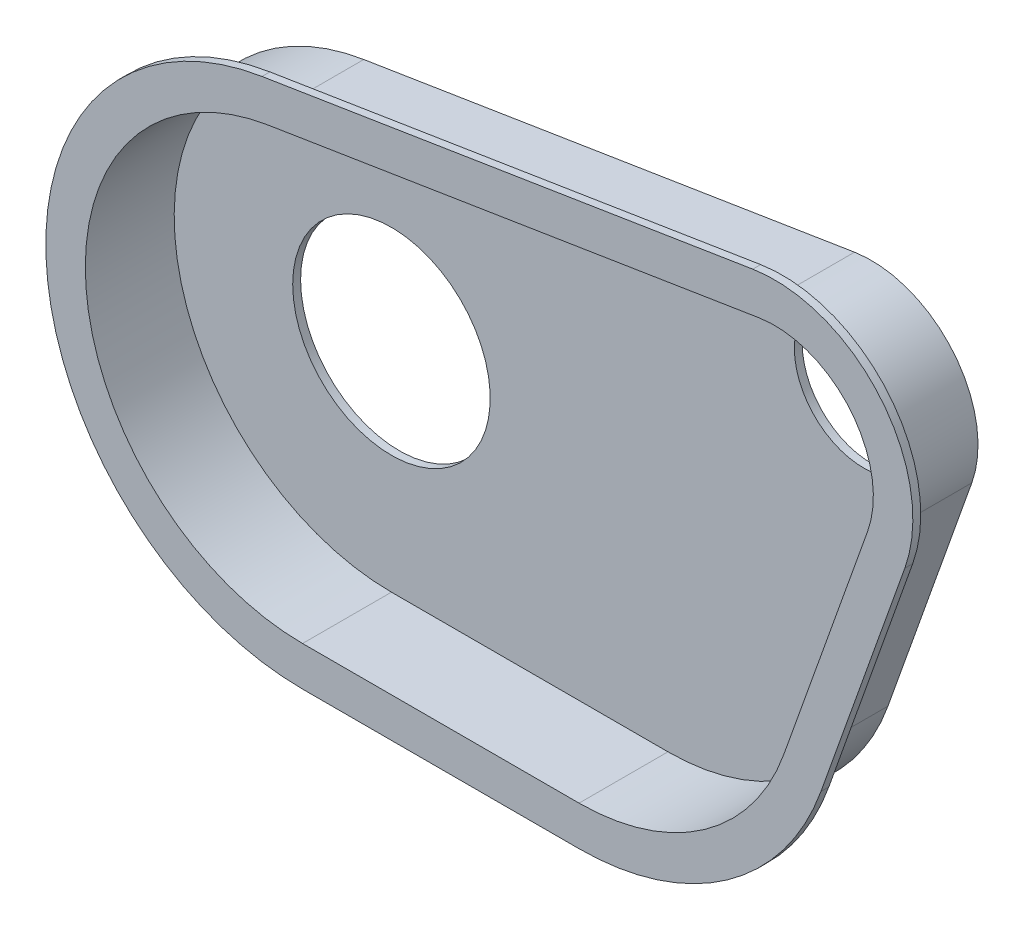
ISO-10303-21;
HEADER;
FILE_DESCRIPTION(('STEP AP214'),'2;1');
FILE_NAME('part.step','',(''),(''),'','','');
FILE_SCHEMA(('AUTOMOTIVE_DESIGN { 1 0 10303 214 1 1 1 1 }'));
ENDSEC;
DATA;
#1=APPLICATION_CONTEXT('core data for automotive mechanical design processes');
#2=APPLICATION_PROTOCOL_DEFINITION('international standard','automotive_design',2000,#1);
#3=PRODUCT_CONTEXT('',#1,'mechanical');
#4=PRODUCT('Part','Part','',(#3));
#5=PRODUCT_RELATED_PRODUCT_CATEGORY('part','',(#4));
#6=PRODUCT_DEFINITION_FORMATION('','',#4);
#7=PRODUCT_DEFINITION_CONTEXT('part definition',#1,'design');
#8=PRODUCT_DEFINITION('design','',#6,#7);
#9=PRODUCT_DEFINITION_SHAPE('','',#8);
#10=(LENGTH_UNIT() NAMED_UNIT(*) SI_UNIT(.MILLI.,.METRE.));
#11=(NAMED_UNIT(*) PLANE_ANGLE_UNIT() SI_UNIT($,.RADIAN.));
#12=(NAMED_UNIT(*) SI_UNIT($,.STERADIAN.) SOLID_ANGLE_UNIT());
#13=UNCERTAINTY_MEASURE_WITH_UNIT(LENGTH_MEASURE(1.E-05),#10,'distance_accuracy_value','');
#14=(GEOMETRIC_REPRESENTATION_CONTEXT(3) GLOBAL_UNCERTAINTY_ASSIGNED_CONTEXT((#13)) GLOBAL_UNIT_ASSIGNED_CONTEXT((#10,
#11,#12)) REPRESENTATION_CONTEXT('',''));
#15=CARTESIAN_POINT('',(0.,0.,0.));
#16=DIRECTION('',(0.,0.,1.));
#17=DIRECTION('',(1.,0.,0.));
#18=AXIS2_PLACEMENT_3D('',#15,#16,#17);
#19=CARTESIAN_POINT('',(151.761792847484,62.8617928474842,28.575));
#20=DIRECTION('',(0.,0.,-1.));
#21=DIRECTION('',(-1.,0.,0.));
#22=AXIS2_PLACEMENT_3D('',#19,#20,#21);
#23=CYLINDRICAL_SURFACE('',#22,34.29);
#24=CARTESIAN_POINT('',(151.761792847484,62.8617928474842,26.035));
#25=DIRECTION('',(0.,0.,1.));
#26=DIRECTION('',(1.,0.,0.));
#27=AXIS2_PLACEMENT_3D('',#24,#25,#26);
#28=CIRCLE('',#27,34.29);
#29=CARTESIAN_POINT('',(184.06030948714,51.3461546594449,26.035));
#30=VERTEX_POINT('',#29);
#31=CARTESIAN_POINT('',(146.345280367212,96.7212891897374,26.035));
#32=VERTEX_POINT('',#31);
#33=EDGE_CURVE('E171',#30,#32,#28,.T.);
#34=ORIENTED_EDGE('',*,*,#33,.F.);
#35=DIRECTION('',(0.,0.,-1.));
#36=VECTOR('',#35,1.);
#37=CARTESIAN_POINT('',(184.06030948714,51.3461546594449,28.575));
#38=LINE('',#37,#36);
#39=CARTESIAN_POINT('',(184.06030948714,51.3461546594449,-2.54));
#40=VERTEX_POINT('',#39);
#41=EDGE_CURVE('E156',#30,#40,#38,.T.);
#42=ORIENTED_EDGE('',*,*,#41,.T.);
#43=CARTESIAN_POINT('',(151.761792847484,62.8617928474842,-2.54));
#44=DIRECTION('',(0.,0.,-1.));
#45=DIRECTION('',(-1.,0.,0.));
#46=AXIS2_PLACEMENT_3D('',#43,#44,#45);
#47=CIRCLE('',#46,34.29);
#48=CARTESIAN_POINT('',(146.345280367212,96.7212891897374,-2.54));
#49=VERTEX_POINT('',#48);
#50=EDGE_CURVE('E251',#49,#40,#47,.T.);
#51=ORIENTED_EDGE('',*,*,#50,.F.);
#52=DIRECTION('',(0.,0.,-1.));
#53=VECTOR('',#52,1.);
#54=CARTESIAN_POINT('',(146.345280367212,96.7212891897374,28.575));
#55=LINE('',#54,#53);
#56=EDGE_CURVE('E11',#32,#49,#55,.T.);
#57=ORIENTED_EDGE('',*,*,#56,.F.);
#58=EDGE_LOOP('',(#34,#42,#51,#57));
#59=FACE_BOUND('',#58,.T.);
#60=ADVANCED_FACE('F33',(#59),#23,.T.);
#61=CARTESIAN_POINT('',(146.345280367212,96.7212891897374,28.575));
#62=DIRECTION('',(0.15796186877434,-0.987445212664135,0.));
#63=DIRECTION('',(0.987445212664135,0.15796186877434,0.));
#64=AXIS2_PLACEMENT_3D('',#61,#62,#63);
#65=PLANE('',#64);
#66=DIRECTION('',(-0.987445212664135,-0.15796186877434,0.));
#67=VECTOR('',#66,1.);
#68=CARTESIAN_POINT('',(-11.4348596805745,71.4811589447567,26.035));
#69=LINE('',#68,#67);
#70=CARTESIAN_POINT('',(-11.4348596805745,71.4811589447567,26.035));
#71=VERTEX_POINT('',#70);
#72=EDGE_CURVE('E46',#32,#71,#69,.T.);
#73=ORIENTED_EDGE('',*,*,#72,.F.);
#74=ORIENTED_EDGE('',*,*,#56,.T.);
#75=DIRECTION('',(0.987445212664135,0.15796186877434,0.));
#76=VECTOR('',#75,1.);
#77=CARTESIAN_POINT('',(-11.4348596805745,71.4811589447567,-2.54));
#78=LINE('',#77,#76);
#79=CARTESIAN_POINT('',(-11.4348596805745,71.4811589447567,-2.54));
#80=VERTEX_POINT('',#79);
#81=EDGE_CURVE('E248',#80,#49,#78,.T.);
#82=ORIENTED_EDGE('',*,*,#81,.F.);
#83=DIRECTION('',(0.,0.,-1.));
#84=VECTOR('',#83,1.);
#85=CARTESIAN_POINT('',(-11.4348596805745,71.4811589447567,28.575));
#86=LINE('',#85,#84);
#87=EDGE_CURVE('E40',#71,#80,#86,.T.);
#88=ORIENTED_EDGE('',*,*,#87,.F.);
#89=EDGE_LOOP('',(#73,#74,#82,#88));
#90=FACE_BOUND('',#89,.T.);
#91=ADVANCED_FACE('F310',(#90),#65,.F.);
#92=CARTESIAN_POINT('',(0.,0.,28.575));
#93=DIRECTION('',(0.,0.,-1.));
#94=DIRECTION('',(-1.,0.,0.));
#95=AXIS2_PLACEMENT_3D('',#92,#93,#94);
#96=CYLINDRICAL_SURFACE('',#95,72.39);
#97=CARTESIAN_POINT('',(0.,0.,26.035));
#98=DIRECTION('',(0.,0.,1.));
#99=DIRECTION('',(1.,0.,0.));
#100=AXIS2_PLACEMENT_3D('',#97,#98,#99);
#101=CIRCLE('',#100,72.39);
#102=CARTESIAN_POINT('',(7.58245002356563E-13,-72.39,26.035));
#103=VERTEX_POINT('',#102);
#104=EDGE_CURVE('E54',#71,#103,#101,.T.);
#105=ORIENTED_EDGE('',*,*,#104,.F.);
#106=ORIENTED_EDGE('',*,*,#87,.T.);
#107=CARTESIAN_POINT('',(0.,0.,-2.54));
#108=DIRECTION('',(0.,0.,-1.));
#109=DIRECTION('',(-1.,0.,0.));
#110=AXIS2_PLACEMENT_3D('',#107,#108,#109);
#111=CIRCLE('',#110,72.39);
#112=CARTESIAN_POINT('',(7.58245002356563E-13,-72.39,-2.54));
#113=VERTEX_POINT('',#112);
#114=EDGE_CURVE('E243',#113,#80,#111,.T.);
#115=ORIENTED_EDGE('',*,*,#114,.F.);
#116=DIRECTION('',(0.,0.,-1.));
#117=VECTOR('',#116,1.);
#118=CARTESIAN_POINT('',(7.58245002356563E-13,-72.39,28.575));
#119=LINE('',#118,#117);
#120=EDGE_CURVE('E306',#103,#113,#119,.T.);
#121=ORIENTED_EDGE('',*,*,#120,.F.);
#122=EDGE_LOOP('',(#105,#106,#115,#121));
#123=FACE_BOUND('',#122,.T.);
#124=ADVANCED_FACE('F309',(#123),#96,.T.);
#125=CARTESIAN_POINT('',(7.58245002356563E-13,-72.39,28.575));
#126=DIRECTION('',(0.,1.,0.));
#127=DIRECTION('',(-1.,0.,0.));
#128=AXIS2_PLACEMENT_3D('',#125,#126,#127);
#129=PLANE('',#128);
#130=DIRECTION('',(1.,0.,0.));
#131=VECTOR('',#130,1.);
#132=CARTESIAN_POINT('',(7.58245002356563E-13,-72.39,26.035));
#133=LINE('',#132,#131);
#134=CARTESIAN_POINT('',(88.9,-72.39,26.035));
#135=VERTEX_POINT('',#134);
#136=EDGE_CURVE('E180',#103,#135,#133,.T.);
#137=ORIENTED_EDGE('',*,*,#136,.F.);
#138=ORIENTED_EDGE('',*,*,#120,.T.);
#139=DIRECTION('',(-1.,0.,0.));
#140=VECTOR('',#139,1.);
#141=CARTESIAN_POINT('',(7.58245002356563E-13,-72.39,-2.54));
#142=LINE('',#141,#140);
#143=CARTESIAN_POINT('',(88.9,-72.39,-2.54));
#144=VERTEX_POINT('',#143);
#145=EDGE_CURVE('E257',#144,#113,#142,.T.);
#146=ORIENTED_EDGE('',*,*,#145,.F.);
#147=DIRECTION('',(0.,0.,-1.));
#148=VECTOR('',#147,1.);
#149=CARTESIAN_POINT('',(88.9,-72.39,28.575));
#150=LINE('',#149,#148);
#151=EDGE_CURVE('E304',#135,#144,#150,.T.);
#152=ORIENTED_EDGE('',*,*,#151,.F.);
#153=EDGE_LOOP('',(#137,#138,#146,#152));
#154=FACE_BOUND('',#153,.T.);
#155=ADVANCED_FACE('F318',(#154),#129,.F.);
#156=CARTESIAN_POINT('',(88.9,0.,28.575));
#157=DIRECTION('',(0.,0.,-1.));
#158=DIRECTION('',(-1.,0.,0.));
#159=AXIS2_PLACEMENT_3D('',#156,#157,#158);
#160=CYLINDRICAL_SURFACE('',#159,72.39);
#161=CARTESIAN_POINT('',(88.9,0.,26.035));
#162=DIRECTION('',(0.,0.,1.));
#163=DIRECTION('',(1.,0.,0.));
#164=AXIS2_PLACEMENT_3D('',#161,#162,#163);
#165=CIRCLE('',#164,72.39);
#166=CARTESIAN_POINT('',(157.085757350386,-24.3107917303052,26.035));
#167=VERTEX_POINT('',#166);
#168=EDGE_CURVE('E178',#135,#167,#165,.T.);
#169=ORIENTED_EDGE('',*,*,#168,.F.);
#170=ORIENTED_EDGE('',*,*,#151,.T.);
#171=CARTESIAN_POINT('',(88.9,0.,-2.54));
#172=DIRECTION('',(0.,0.,-1.));
#173=DIRECTION('',(-1.,0.,0.));
#174=AXIS2_PLACEMENT_3D('',#171,#172,#173);
#175=CIRCLE('',#174,72.39);
#176=CARTESIAN_POINT('',(157.085757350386,-24.3107917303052,-2.54));
#177=VERTEX_POINT('',#176);
#178=EDGE_CURVE('E254',#177,#144,#175,.T.);
#179=ORIENTED_EDGE('',*,*,#178,.F.);
#180=DIRECTION('',(0.,0.,-1.));
#181=VECTOR('',#180,1.);
#182=CARTESIAN_POINT('',(157.085757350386,-24.3107917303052,28.575));
#183=LINE('',#182,#181);
#184=EDGE_CURVE('E167',#167,#177,#183,.T.);
#185=ORIENTED_EDGE('',*,*,#184,.F.);
#186=EDGE_LOOP('',(#169,#170,#179,#185));
#187=FACE_BOUND('',#186,.T.);
#188=ADVANCED_FACE('F321',(#187),#160,.T.);
#189=CARTESIAN_POINT('',(184.06030948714,51.3461546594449,28.575));
#190=DIRECTION('',(-0.941922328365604,0.335830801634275,0.));
#191=DIRECTION('',(-0.335830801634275,-0.941922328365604,0.));
#192=AXIS2_PLACEMENT_3D('',#189,#190,#191);
#193=PLANE('',#192);
#194=DIRECTION('',(0.335830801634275,0.941922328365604,0.));
#195=VECTOR('',#194,1.);
#196=CARTESIAN_POINT('',(157.085757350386,-24.3107917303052,26.035));
#197=LINE('',#196,#195);
#198=EDGE_CURVE('E160',#167,#30,#197,.T.);
#199=ORIENTED_EDGE('',*,*,#198,.F.);
#200=ORIENTED_EDGE('',*,*,#184,.T.);
#201=DIRECTION('',(-0.335830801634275,-0.941922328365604,0.));
#202=VECTOR('',#201,1.);
#203=CARTESIAN_POINT('',(184.06030948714,51.3461546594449,-2.54));
#204=LINE('',#203,#202);
#205=EDGE_CURVE('E163',#40,#177,#204,.T.);
#206=ORIENTED_EDGE('',*,*,#205,.F.);
#207=ORIENTED_EDGE('',*,*,#41,.F.);
#208=EDGE_LOOP('',(#199,#200,#206,#207));
#209=FACE_BOUND('',#208,.T.);
#210=ADVANCED_FACE('F158',(#209),#193,.F.);
#211=CARTESIAN_POINT('',(151.761792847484,62.8617928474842,28.575));
#212=DIRECTION('',(0.,0.,1.));
#213=DIRECTION('',(1.,0.,0.));
#214=AXIS2_PLACEMENT_3D('',#211,#212,#213);
#215=PLANE('',#214);
#216=DIRECTION('',(1.,0.,0.));
#217=VECTOR('',#216,1.);
#218=CARTESIAN_POINT('',(88.9,-69.85,28.575));
#219=LINE('',#218,#217);
#220=CARTESIAN_POINT('',(7.31639914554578E-13,-69.85,28.575));
#221=VERTEX_POINT('',#220);
#222=CARTESIAN_POINT('',(88.9,-69.85,28.575));
#223=VERTEX_POINT('',#222);
#224=EDGE_CURVE('E263',#221,#223,#219,.T.);
#225=ORIENTED_EDGE('',*,*,#224,.F.);
#226=CARTESIAN_POINT('',(0.,0.,28.575));
#227=DIRECTION('',(0.,0.,1.));
#228=DIRECTION('',(1.,0.,0.));
#229=AXIS2_PLACEMENT_3D('',#226,#227,#228);
#230=CIRCLE('',#229,69.85);
#231=CARTESIAN_POINT('',(-11.0336365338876,68.9730481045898,28.575));
#232=VERTEX_POINT('',#231);
#233=EDGE_CURVE('E261',#232,#221,#230,.T.);
#234=ORIENTED_EDGE('',*,*,#233,.F.);
#235=DIRECTION('',(-0.987445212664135,-0.15796186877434,0.));
#236=VECTOR('',#235,1.);
#237=CARTESIAN_POINT('',(-11.0336365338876,68.9730481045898,28.575));
#238=LINE('',#237,#236);
#239=CARTESIAN_POINT('',(146.746503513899,94.2131783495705,28.575));
#240=VERTEX_POINT('',#239);
#241=EDGE_CURVE('E273',#240,#232,#238,.T.);
#242=ORIENTED_EDGE('',*,*,#241,.F.);
#243=CARTESIAN_POINT('',(151.761792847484,62.8617928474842,28.575));
#244=DIRECTION('',(0.,0.,1.));
#245=DIRECTION('',(1.,0.,0.));
#246=AXIS2_PLACEMENT_3D('',#243,#244,#245);
#247=CIRCLE('',#246,31.75);
#248=CARTESIAN_POINT('',(181.667826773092,52.199164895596,28.575));
#249=VERTEX_POINT('',#248);
#250=EDGE_CURVE('E270',#249,#240,#247,.T.);
#251=ORIENTED_EDGE('',*,*,#250,.F.);
#252=DIRECTION('',(0.335830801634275,0.941922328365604,0.));
#253=VECTOR('',#252,1.);
#254=CARTESIAN_POINT('',(181.667826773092,52.199164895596,28.575));
#255=LINE('',#254,#253);
#256=CARTESIAN_POINT('',(154.693274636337,-23.4577814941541,28.575));
#257=VERTEX_POINT('',#256);
#258=EDGE_CURVE('E268',#257,#249,#255,.T.);
#259=ORIENTED_EDGE('',*,*,#258,.F.);
#260=CARTESIAN_POINT('',(88.9,0.,28.575));
#261=DIRECTION('',(0.,0.,1.));
#262=DIRECTION('',(1.,0.,0.));
#263=AXIS2_PLACEMENT_3D('',#260,#261,#262);
#264=CIRCLE('',#263,69.85);
#265=EDGE_CURVE('E266',#223,#257,#264,.T.);
#266=ORIENTED_EDGE('',*,*,#265,.F.);
#267=EDGE_LOOP('',(#225,#234,#242,#251,#259,#266));
#268=FACE_BOUND('',#267,.T.);
#269=CARTESIAN_POINT('',(0.,0.,28.575));
#270=DIRECTION('',(0.,0.,1.));
#271=DIRECTION('',(1.,0.,0.));
#272=AXIS2_PLACEMENT_3D('',#269,#270,#271);
#273=CIRCLE('',#272,82.55);
#274=CARTESIAN_POINT('',(-13.0397522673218,81.5136023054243,28.575));
#275=VERTEX_POINT('',#274);
#276=CARTESIAN_POINT('',(7.58245002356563E-13,-82.55,28.575));
#277=VERTEX_POINT('',#276);
#278=EDGE_CURVE('E185',#275,#277,#273,.T.);
#279=ORIENTED_EDGE('',*,*,#278,.T.);
#280=DIRECTION('',(1.,0.,0.));
#281=VECTOR('',#280,1.);
#282=CARTESIAN_POINT('',(7.58245002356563E-13,-82.55,28.575));
#283=LINE('',#282,#281);
#284=CARTESIAN_POINT('',(88.9,-82.55,28.575));
#285=VERTEX_POINT('',#284);
#286=EDGE_CURVE('E208',#277,#285,#283,.T.);
#287=ORIENTED_EDGE('',*,*,#286,.T.);
#288=CARTESIAN_POINT('',(88.9,0.,28.575));
#289=DIRECTION('',(0.,0.,1.));
#290=DIRECTION('',(1.,0.,0.));
#291=AXIS2_PLACEMENT_3D('',#288,#289,#290);
#292=CIRCLE('',#291,82.55);
#293=CARTESIAN_POINT('',(166.655688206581,-27.7228326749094,28.575));
#294=VERTEX_POINT('',#293);
#295=EDGE_CURVE('E211',#285,#294,#292,.T.);
#296=ORIENTED_EDGE('',*,*,#295,.T.);
#297=DIRECTION('',(0.335830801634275,0.941922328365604,0.));
#298=VECTOR('',#297,1.);
#299=CARTESIAN_POINT('',(166.655688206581,-27.7228326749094,28.575));
#300=LINE('',#299,#298);
#301=CARTESIAN_POINT('',(193.630240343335,47.9341137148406,28.575));
#302=VERTEX_POINT('',#301);
#303=EDGE_CURVE('E214',#294,#302,#300,.T.);
#304=ORIENTED_EDGE('',*,*,#303,.T.);
#305=CARTESIAN_POINT('',(151.761792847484,62.8617928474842,28.575));
#306=DIRECTION('',(0.,0.,1.));
#307=DIRECTION('',(1.,0.,0.));
#308=AXIS2_PLACEMENT_3D('',#305,#306,#307);
#309=CIRCLE('',#308,44.45);
#310=CARTESIAN_POINT('',(144.740387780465,106.753732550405,28.575));
#311=VERTEX_POINT('',#310);
#312=EDGE_CURVE('E217',#302,#311,#309,.T.);
#313=ORIENTED_EDGE('',*,*,#312,.T.);
#314=DIRECTION('',(-0.987445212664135,-0.15796186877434,0.));
#315=VECTOR('',#314,1.);
#316=CARTESIAN_POINT('',(-13.0397522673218,81.5136023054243,28.575));
#317=LINE('',#316,#315);
#318=EDGE_CURVE('E190',#311,#275,#317,.T.);
#319=ORIENTED_EDGE('',*,*,#318,.T.);
#320=EDGE_LOOP('',(#279,#287,#296,#304,#313,#319));
#321=FACE_BOUND('',#320,.T.);
#322=ADVANCED_FACE('F328',(#268,#321),#215,.T.);
#323=CARTESIAN_POINT('',(0.,0.,28.575));
#324=DIRECTION('',(0.,0.,-1.));
#325=DIRECTION('',(-1.,0.,0.));
#326=AXIS2_PLACEMENT_3D('',#323,#324,#325);
#327=CYLINDRICAL_SURFACE('',#326,69.85);
#328=CARTESIAN_POINT('',(0.,0.,0.));
#329=DIRECTION('',(0.,0.,1.));
#330=DIRECTION('',(1.,0.,0.));
#331=AXIS2_PLACEMENT_3D('',#328,#329,#330);
#332=CIRCLE('',#331,69.85);
#333=CARTESIAN_POINT('',(-11.0336365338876,68.9730481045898,0.));
#334=VERTEX_POINT('',#333);
#335=CARTESIAN_POINT('',(7.31639914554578E-13,-69.85,0.));
#336=VERTEX_POINT('',#335);
#337=EDGE_CURVE('E260',#334,#336,#332,.T.);
#338=ORIENTED_EDGE('',*,*,#337,.F.);
#339=DIRECTION('',(0.,0.,-1.));
#340=VECTOR('',#339,1.);
#341=CARTESIAN_POINT('',(-11.0336365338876,68.9730481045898,28.575));
#342=LINE('',#341,#340);
#343=EDGE_CURVE('E275',#232,#334,#342,.T.);
#344=ORIENTED_EDGE('',*,*,#343,.F.);
#345=ORIENTED_EDGE('',*,*,#233,.T.);
#346=DIRECTION('',(0.,0.,-1.));
#347=VECTOR('',#346,1.);
#348=CARTESIAN_POINT('',(7.31639914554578E-13,-69.85,28.575));
#349=LINE('',#348,#347);
#350=EDGE_CURVE('E168',#221,#336,#349,.T.);
#351=ORIENTED_EDGE('',*,*,#350,.T.);
#352=EDGE_LOOP('',(#338,#344,#345,#351));
#353=FACE_BOUND('',#352,.T.);
#354=ADVANCED_FACE('F368',(#353),#327,.F.);
#355=CARTESIAN_POINT('',(88.9,-69.85,28.575));
#356=DIRECTION('',(0.,1.,0.));
#357=DIRECTION('',(-1.,0.,0.));
#358=AXIS2_PLACEMENT_3D('',#355,#356,#357);
#359=PLANE('',#358);
#360=DIRECTION('',(1.,0.,0.));
#361=VECTOR('',#360,1.);
#362=CARTESIAN_POINT('',(88.9,-69.85,0.));
#363=LINE('',#362,#361);
#364=CARTESIAN_POINT('',(88.9,-69.85,0.));
#365=VERTEX_POINT('',#364);
#366=EDGE_CURVE('E278',#336,#365,#363,.T.);
#367=ORIENTED_EDGE('',*,*,#366,.F.);
#368=ORIENTED_EDGE('',*,*,#350,.F.);
#369=ORIENTED_EDGE('',*,*,#224,.T.);
#370=DIRECTION('',(0.,0.,-1.));
#371=VECTOR('',#370,1.);
#372=CARTESIAN_POINT('',(88.9,-69.85,28.575));
#373=LINE('',#372,#371);
#374=EDGE_CURVE('E299',#223,#365,#373,.T.);
#375=ORIENTED_EDGE('',*,*,#374,.T.);
#376=EDGE_LOOP('',(#367,#368,#369,#375));
#377=FACE_BOUND('',#376,.T.);
#378=ADVANCED_FACE('F475',(#377),#359,.T.);
#379=CARTESIAN_POINT('',(88.9,0.,28.575));
#380=DIRECTION('',(0.,0.,-1.));
#381=DIRECTION('',(-1.,0.,0.));
#382=AXIS2_PLACEMENT_3D('',#379,#380,#381);
#383=CYLINDRICAL_SURFACE('',#382,69.85);
#384=CARTESIAN_POINT('',(88.9,0.,0.));
#385=DIRECTION('',(0.,0.,1.));
#386=DIRECTION('',(1.,0.,0.));
#387=AXIS2_PLACEMENT_3D('',#384,#385,#386);
#388=CIRCLE('',#387,69.85);
#389=CARTESIAN_POINT('',(154.693274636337,-23.4577814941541,0.));
#390=VERTEX_POINT('',#389);
#391=EDGE_CURVE('E281',#365,#390,#388,.T.);
#392=ORIENTED_EDGE('',*,*,#391,.F.);
#393=ORIENTED_EDGE('',*,*,#374,.F.);
#394=ORIENTED_EDGE('',*,*,#265,.T.);
#395=DIRECTION('',(0.,0.,-1.));
#396=VECTOR('',#395,1.);
#397=CARTESIAN_POINT('',(154.693274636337,-23.4577814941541,28.575));
#398=LINE('',#397,#396);
#399=EDGE_CURVE('E297',#257,#390,#398,.T.);
#400=ORIENTED_EDGE('',*,*,#399,.T.);
#401=EDGE_LOOP('',(#392,#393,#394,#400));
#402=FACE_BOUND('',#401,.T.);
#403=ADVANCED_FACE('F471',(#402),#383,.F.);
#404=CARTESIAN_POINT('',(181.667826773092,52.199164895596,28.575));
#405=DIRECTION('',(-0.941922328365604,0.335830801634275,0.));
#406=DIRECTION('',(-0.335830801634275,-0.941922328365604,0.));
#407=AXIS2_PLACEMENT_3D('',#404,#405,#406);
#408=PLANE('',#407);
#409=DIRECTION('',(0.335830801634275,0.941922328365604,0.));
#410=VECTOR('',#409,1.);
#411=CARTESIAN_POINT('',(181.667826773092,52.199164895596,0.));
#412=LINE('',#411,#410);
#413=CARTESIAN_POINT('',(181.667826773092,52.199164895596,0.));
#414=VERTEX_POINT('',#413);
#415=EDGE_CURVE('E284',#390,#414,#412,.T.);
#416=ORIENTED_EDGE('',*,*,#415,.F.);
#417=ORIENTED_EDGE('',*,*,#399,.F.);
#418=ORIENTED_EDGE('',*,*,#258,.T.);
#419=DIRECTION('',(0.,0.,-1.));
#420=VECTOR('',#419,1.);
#421=CARTESIAN_POINT('',(181.667826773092,52.199164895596,28.575));
#422=LINE('',#421,#420);
#423=EDGE_CURVE('E295',#249,#414,#422,.T.);
#424=ORIENTED_EDGE('',*,*,#423,.T.);
#425=EDGE_LOOP('',(#416,#417,#418,#424));
#426=FACE_BOUND('',#425,.T.);
#427=ADVANCED_FACE('F467',(#426),#408,.T.);
#428=CARTESIAN_POINT('',(151.761792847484,62.8617928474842,28.575));
#429=DIRECTION('',(0.,0.,-1.));
#430=DIRECTION('',(-1.,0.,0.));
#431=AXIS2_PLACEMENT_3D('',#428,#429,#430);
#432=CYLINDRICAL_SURFACE('',#431,31.75);
#433=CARTESIAN_POINT('',(151.761792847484,62.8617928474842,0.));
#434=DIRECTION('',(0.,0.,1.));
#435=DIRECTION('',(1.,0.,0.));
#436=AXIS2_PLACEMENT_3D('',#433,#434,#435);
#437=CIRCLE('',#436,31.75);
#438=CARTESIAN_POINT('',(146.746503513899,94.2131783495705,0.));
#439=VERTEX_POINT('',#438);
#440=EDGE_CURVE('E287',#414,#439,#437,.T.);
#441=ORIENTED_EDGE('',*,*,#440,.F.);
#442=ORIENTED_EDGE('',*,*,#423,.F.);
#443=ORIENTED_EDGE('',*,*,#250,.T.);
#444=DIRECTION('',(0.,0.,-1.));
#445=VECTOR('',#444,1.);
#446=CARTESIAN_POINT('',(146.746503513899,94.2131783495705,28.575));
#447=LINE('',#446,#445);
#448=EDGE_CURVE('E293',#240,#439,#447,.T.);
#449=ORIENTED_EDGE('',*,*,#448,.T.);
#450=EDGE_LOOP('',(#441,#442,#443,#449));
#451=FACE_BOUND('',#450,.T.);
#452=ADVANCED_FACE('F463',(#451),#432,.F.);
#453=CARTESIAN_POINT('',(-11.0336365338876,68.9730481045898,28.575));
#454=DIRECTION('',(0.15796186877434,-0.987445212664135,0.));
#455=DIRECTION('',(0.987445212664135,0.15796186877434,0.));
#456=AXIS2_PLACEMENT_3D('',#453,#454,#455);
#457=PLANE('',#456);
#458=DIRECTION('',(-0.987445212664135,-0.15796186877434,0.));
#459=VECTOR('',#458,1.);
#460=CARTESIAN_POINT('',(-11.0336365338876,68.9730481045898,0.));
#461=LINE('',#460,#459);
#462=EDGE_CURVE('E264',#439,#334,#461,.T.);
#463=ORIENTED_EDGE('',*,*,#462,.F.);
#464=ORIENTED_EDGE('',*,*,#448,.F.);
#465=ORIENTED_EDGE('',*,*,#241,.T.);
#466=ORIENTED_EDGE('',*,*,#343,.T.);
#467=EDGE_LOOP('',(#463,#464,#465,#466));
#468=FACE_BOUND('',#467,.T.);
#469=ADVANCED_FACE('F456',(#468),#457,.T.);
#470=CARTESIAN_POINT('',(0.,0.,-2.54));
#471=DIRECTION('',(0.,0.,-1.));
#472=DIRECTION('',(-1.,0.,0.));
#473=AXIS2_PLACEMENT_3D('',#470,#471,#472);
#474=PLANE('',#473);
#475=CARTESIAN_POINT('',(151.761792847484,62.8617928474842,-2.54));
#476=DIRECTION('',(0.,0.,-1.));
#477=DIRECTION('',(-1.,0.,0.));
#478=AXIS2_PLACEMENT_3D('',#475,#476,#477);
#479=CIRCLE('',#478,22.225);
#480=CARTESIAN_POINT('',(129.536792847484,62.8617928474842,-2.54));
#481=VERTEX_POINT('',#480);
#482=EDGE_CURVE('E240',#481,#481,#479,.T.);
#483=ORIENTED_EDGE('',*,*,#482,.F.);
#484=EDGE_LOOP('',(#483));
#485=FACE_BOUND('',#484,.T.);
#486=ORIENTED_EDGE('',*,*,#114,.T.);
#487=ORIENTED_EDGE('',*,*,#81,.T.);
#488=ORIENTED_EDGE('',*,*,#50,.T.);
#489=ORIENTED_EDGE('',*,*,#205,.T.);
#490=ORIENTED_EDGE('',*,*,#178,.T.);
#491=ORIENTED_EDGE('',*,*,#145,.T.);
#492=EDGE_LOOP('',(#486,#487,#488,#489,#490,#491));
#493=FACE_BOUND('',#492,.T.);
#494=CARTESIAN_POINT('',(0.,0.,-2.54));
#495=DIRECTION('',(0.,0.,-1.));
#496=DIRECTION('',(-1.,0.,0.));
#497=AXIS2_PLACEMENT_3D('',#494,#495,#496);
#498=CIRCLE('',#497,31.75);
#499=CARTESIAN_POINT('',(-31.75,0.,-2.54));
#500=VERTEX_POINT('',#499);
#501=EDGE_CURVE('E234',#500,#500,#498,.T.);
#502=ORIENTED_EDGE('',*,*,#501,.F.);
#503=EDGE_LOOP('',(#502));
#504=FACE_BOUND('',#503,.T.);
#505=ADVANCED_FACE('F312',(#485,#493,#504),#474,.T.);
#506=CARTESIAN_POINT('',(0.,0.,0.));
#507=DIRECTION('',(0.,0.,-1.));
#508=DIRECTION('',(-1.,0.,0.));
#509=AXIS2_PLACEMENT_3D('',#506,#507,#508);
#510=PLANE('',#509);
#511=ORIENTED_EDGE('',*,*,#337,.T.);
#512=ORIENTED_EDGE('',*,*,#366,.T.);
#513=ORIENTED_EDGE('',*,*,#391,.T.);
#514=ORIENTED_EDGE('',*,*,#415,.T.);
#515=ORIENTED_EDGE('',*,*,#440,.T.);
#516=ORIENTED_EDGE('',*,*,#462,.T.);
#517=EDGE_LOOP('',(#511,#512,#513,#514,#515,#516));
#518=FACE_BOUND('',#517,.T.);
#519=CARTESIAN_POINT('',(151.761792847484,62.8617928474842,0.));
#520=DIRECTION('',(0.,0.,-1.));
#521=DIRECTION('',(-1.,0.,0.));
#522=AXIS2_PLACEMENT_3D('',#519,#520,#521);
#523=CIRCLE('',#522,22.225);
#524=CARTESIAN_POINT('',(129.536792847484,62.8617928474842,0.));
#525=VERTEX_POINT('',#524);
#526=EDGE_CURVE('E237',#525,#525,#523,.T.);
#527=ORIENTED_EDGE('',*,*,#526,.T.);
#528=EDGE_LOOP('',(#527));
#529=FACE_BOUND('',#528,.T.);
#530=CARTESIAN_POINT('',(0.,0.,0.));
#531=DIRECTION('',(0.,0.,-1.));
#532=DIRECTION('',(-1.,0.,0.));
#533=AXIS2_PLACEMENT_3D('',#530,#531,#532);
#534=CIRCLE('',#533,31.75);
#535=CARTESIAN_POINT('',(-31.75,0.,0.));
#536=VERTEX_POINT('',#535);
#537=EDGE_CURVE('E224',#536,#536,#534,.T.);
#538=ORIENTED_EDGE('',*,*,#537,.T.);
#539=EDGE_LOOP('',(#538));
#540=FACE_BOUND('',#539,.T.);
#541=ADVANCED_FACE('F452',(#518,#529,#540),#510,.F.);
#542=CARTESIAN_POINT('',(151.761792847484,62.8617928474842,-2.54));
#543=DIRECTION('',(0.,0.,1.));
#544=DIRECTION('',(1.,0.,0.));
#545=AXIS2_PLACEMENT_3D('',#542,#543,#544);
#546=CYLINDRICAL_SURFACE('',#545,22.225);
#547=ORIENTED_EDGE('',*,*,#482,.T.);
#548=EDGE_LOOP('',(#547));
#549=FACE_BOUND('',#548,.T.);
#550=ORIENTED_EDGE('',*,*,#526,.F.);
#551=EDGE_LOOP('',(#550));
#552=FACE_BOUND('',#551,.T.);
#553=ADVANCED_FACE('F448',(#549,#552),#546,.F.);
#554=CARTESIAN_POINT('',(0.,0.,-2.54));
#555=DIRECTION('',(0.,0.,1.));
#556=DIRECTION('',(1.,0.,0.));
#557=AXIS2_PLACEMENT_3D('',#554,#555,#556);
#558=CYLINDRICAL_SURFACE('',#557,31.75);
#559=ORIENTED_EDGE('',*,*,#501,.T.);
#560=EDGE_LOOP('',(#559));
#561=FACE_BOUND('',#560,.T.);
#562=ORIENTED_EDGE('',*,*,#537,.F.);
#563=EDGE_LOOP('',(#562));
#564=FACE_BOUND('',#563,.T.);
#565=ADVANCED_FACE('F383',(#561,#564),#558,.F.);
#566=CARTESIAN_POINT('',(0.,0.,26.035));
#567=DIRECTION('',(0.,0.,1.));
#568=DIRECTION('',(1.,0.,0.));
#569=AXIS2_PLACEMENT_3D('',#566,#567,#568);
#570=CYLINDRICAL_SURFACE('',#569,82.55);
#571=ORIENTED_EDGE('',*,*,#278,.F.);
#572=DIRECTION('',(0.,0.,1.));
#573=VECTOR('',#572,1.);
#574=CARTESIAN_POINT('',(-13.0397522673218,81.5136023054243,26.035));
#575=LINE('',#574,#573);
#576=CARTESIAN_POINT('',(-13.0397522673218,81.5136023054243,26.035));
#577=VERTEX_POINT('',#576);
#578=EDGE_CURVE('E222',#577,#275,#575,.T.);
#579=ORIENTED_EDGE('',*,*,#578,.F.);
#580=CARTESIAN_POINT('',(0.,0.,26.035));
#581=DIRECTION('',(0.,0.,1.));
#582=DIRECTION('',(1.,0.,0.));
#583=AXIS2_PLACEMENT_3D('',#580,#581,#582);
#584=CIRCLE('',#583,82.55);
#585=CARTESIAN_POINT('',(7.58245002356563E-13,-82.55,26.035));
#586=VERTEX_POINT('',#585);
#587=EDGE_CURVE('E186',#577,#586,#584,.T.);
#588=ORIENTED_EDGE('',*,*,#587,.T.);
#589=DIRECTION('',(0.,0.,1.));
#590=VECTOR('',#589,1.);
#591=CARTESIAN_POINT('',(7.58245002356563E-13,-82.55,26.035));
#592=LINE('',#591,#590);
#593=EDGE_CURVE('E205',#586,#277,#592,.T.);
#594=ORIENTED_EDGE('',*,*,#593,.T.);
#595=EDGE_LOOP('',(#571,#579,#588,#594));
#596=FACE_BOUND('',#595,.T.);
#597=ADVANCED_FACE('F378',(#596),#570,.T.);
#598=CARTESIAN_POINT('',(-13.0397522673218,81.5136023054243,26.035));
#599=DIRECTION('',(-0.15796186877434,0.987445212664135,0.));
#600=DIRECTION('',(-0.987445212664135,-0.15796186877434,0.));
#601=AXIS2_PLACEMENT_3D('',#598,#599,#600);
#602=PLANE('',#601);
#603=ORIENTED_EDGE('',*,*,#318,.F.);
#604=DIRECTION('',(0.,0.,1.));
#605=VECTOR('',#604,1.);
#606=CARTESIAN_POINT('',(144.740387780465,106.753732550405,26.035));
#607=LINE('',#606,#605);
#608=CARTESIAN_POINT('',(144.740387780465,106.753732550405,26.035));
#609=VERTEX_POINT('',#608);
#610=EDGE_CURVE('E225',#609,#311,#607,.T.);
#611=ORIENTED_EDGE('',*,*,#610,.F.);
#612=DIRECTION('',(-0.987445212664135,-0.15796186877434,0.));
#613=VECTOR('',#612,1.);
#614=CARTESIAN_POINT('',(-13.0397522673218,81.5136023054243,26.035));
#615=LINE('',#614,#613);
#616=EDGE_CURVE('E202',#609,#577,#615,.T.);
#617=ORIENTED_EDGE('',*,*,#616,.T.);
#618=ORIENTED_EDGE('',*,*,#578,.T.);
#619=EDGE_LOOP('',(#603,#611,#617,#618));
#620=FACE_BOUND('',#619,.T.);
#621=ADVANCED_FACE('F382',(#620),#602,.T.);
#622=CARTESIAN_POINT('',(151.761792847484,62.8617928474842,26.035));
#623=DIRECTION('',(0.,0.,1.));
#624=DIRECTION('',(1.,0.,0.));
#625=AXIS2_PLACEMENT_3D('',#622,#623,#624);
#626=CYLINDRICAL_SURFACE('',#625,44.45);
#627=ORIENTED_EDGE('',*,*,#312,.F.);
#628=DIRECTION('',(0.,0.,1.));
#629=VECTOR('',#628,1.);
#630=CARTESIAN_POINT('',(193.630240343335,47.9341137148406,26.035));
#631=LINE('',#630,#629);
#632=CARTESIAN_POINT('',(193.630240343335,47.9341137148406,26.035));
#633=VERTEX_POINT('',#632);
#634=EDGE_CURVE('E227',#633,#302,#631,.T.);
#635=ORIENTED_EDGE('',*,*,#634,.F.);
#636=CARTESIAN_POINT('',(151.761792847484,62.8617928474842,26.035));
#637=DIRECTION('',(0.,0.,1.));
#638=DIRECTION('',(1.,0.,0.));
#639=AXIS2_PLACEMENT_3D('',#636,#637,#638);
#640=CIRCLE('',#639,44.45);
#641=EDGE_CURVE('E199',#633,#609,#640,.T.);
#642=ORIENTED_EDGE('',*,*,#641,.T.);
#643=ORIENTED_EDGE('',*,*,#610,.T.);
#644=EDGE_LOOP('',(#627,#635,#642,#643));
#645=FACE_BOUND('',#644,.T.);
#646=ADVANCED_FACE('F394',(#645),#626,.T.);
#647=CARTESIAN_POINT('',(166.655688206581,-27.7228326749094,26.035));
#648=DIRECTION('',(0.941922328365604,-0.335830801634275,0.));
#649=DIRECTION('',(0.335830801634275,0.941922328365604,0.));
#650=AXIS2_PLACEMENT_3D('',#647,#648,#649);
#651=PLANE('',#650);
#652=ORIENTED_EDGE('',*,*,#303,.F.);
#653=DIRECTION('',(0.,0.,1.));
#654=VECTOR('',#653,1.);
#655=CARTESIAN_POINT('',(166.655688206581,-27.7228326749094,26.035));
#656=LINE('',#655,#654);
#657=CARTESIAN_POINT('',(166.655688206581,-27.7228326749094,26.035));
#658=VERTEX_POINT('',#657);
#659=EDGE_CURVE('E229',#658,#294,#656,.T.);
#660=ORIENTED_EDGE('',*,*,#659,.F.);
#661=DIRECTION('',(0.335830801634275,0.941922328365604,0.));
#662=VECTOR('',#661,1.);
#663=CARTESIAN_POINT('',(166.655688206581,-27.7228326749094,26.035));
#664=LINE('',#663,#662);
#665=EDGE_CURVE('E196',#658,#633,#664,.T.);
#666=ORIENTED_EDGE('',*,*,#665,.T.);
#667=ORIENTED_EDGE('',*,*,#634,.T.);
#668=EDGE_LOOP('',(#652,#660,#666,#667));
#669=FACE_BOUND('',#668,.T.);
#670=ADVANCED_FACE('F404',(#669),#651,.T.);
#671=CARTESIAN_POINT('',(88.9,0.,26.035));
#672=DIRECTION('',(0.,0.,1.));
#673=DIRECTION('',(1.,0.,0.));
#674=AXIS2_PLACEMENT_3D('',#671,#672,#673);
#675=CYLINDRICAL_SURFACE('',#674,82.55);
#676=ORIENTED_EDGE('',*,*,#295,.F.);
#677=DIRECTION('',(0.,0.,1.));
#678=VECTOR('',#677,1.);
#679=CARTESIAN_POINT('',(88.9,-82.55,26.035));
#680=LINE('',#679,#678);
#681=CARTESIAN_POINT('',(88.9,-82.55,26.035));
#682=VERTEX_POINT('',#681);
#683=EDGE_CURVE('E231',#682,#285,#680,.T.);
#684=ORIENTED_EDGE('',*,*,#683,.F.);
#685=CARTESIAN_POINT('',(88.9,0.,26.035));
#686=DIRECTION('',(0.,0.,1.));
#687=DIRECTION('',(1.,0.,0.));
#688=AXIS2_PLACEMENT_3D('',#685,#686,#687);
#689=CIRCLE('',#688,82.55);
#690=EDGE_CURVE('E193',#682,#658,#689,.T.);
#691=ORIENTED_EDGE('',*,*,#690,.T.);
#692=ORIENTED_EDGE('',*,*,#659,.T.);
#693=EDGE_LOOP('',(#676,#684,#691,#692));
#694=FACE_BOUND('',#693,.T.);
#695=ADVANCED_FACE('F414',(#694),#675,.T.);
#696=CARTESIAN_POINT('',(7.58245002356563E-13,-82.55,26.035));
#697=DIRECTION('',(0.,-1.,0.));
#698=DIRECTION('',(1.,0.,0.));
#699=AXIS2_PLACEMENT_3D('',#696,#697,#698);
#700=PLANE('',#699);
#701=ORIENTED_EDGE('',*,*,#286,.F.);
#702=ORIENTED_EDGE('',*,*,#593,.F.);
#703=DIRECTION('',(1.,0.,0.));
#704=VECTOR('',#703,1.);
#705=CARTESIAN_POINT('',(7.58245002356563E-13,-82.55,26.035));
#706=LINE('',#705,#704);
#707=EDGE_CURVE('E189',#586,#682,#706,.T.);
#708=ORIENTED_EDGE('',*,*,#707,.T.);
#709=ORIENTED_EDGE('',*,*,#683,.T.);
#710=EDGE_LOOP('',(#701,#702,#708,#709));
#711=FACE_BOUND('',#710,.T.);
#712=ADVANCED_FACE('F424',(#711),#700,.T.);
#713=CARTESIAN_POINT('',(0.,0.,26.035));
#714=DIRECTION('',(0.,0.,1.));
#715=DIRECTION('',(1.,0.,0.));
#716=AXIS2_PLACEMENT_3D('',#713,#714,#715);
#717=PLANE('',#716);
#718=ORIENTED_EDGE('',*,*,#72,.T.);
#719=ORIENTED_EDGE('',*,*,#104,.T.);
#720=ORIENTED_EDGE('',*,*,#136,.T.);
#721=ORIENTED_EDGE('',*,*,#168,.T.);
#722=ORIENTED_EDGE('',*,*,#198,.T.);
#723=ORIENTED_EDGE('',*,*,#33,.T.);
#724=EDGE_LOOP('',(#718,#719,#720,#721,#722,#723));
#725=FACE_BOUND('',#724,.T.);
#726=ORIENTED_EDGE('',*,*,#587,.F.);
#727=ORIENTED_EDGE('',*,*,#616,.F.);
#728=ORIENTED_EDGE('',*,*,#641,.F.);
#729=ORIENTED_EDGE('',*,*,#665,.F.);
#730=ORIENTED_EDGE('',*,*,#690,.F.);
#731=ORIENTED_EDGE('',*,*,#707,.F.);
#732=EDGE_LOOP('',(#726,#727,#728,#729,#730,#731));
#733=FACE_BOUND('',#732,.T.);
#734=ADVANCED_FACE('F175',(#725,#733),#717,.F.);
#735=CLOSED_SHELL('',(#60,#91,#124,#155,#188,#210,#322,#354,#378,#403,#427,#452,#469,#505,#541,
#553,#565,#597,#621,#646,#670,#695,#712,#734));
#736=MANIFOLD_SOLID_BREP('B2',#735);
#737=ADVANCED_BREP_SHAPE_REPRESENTATION('',(#18,#736),#14);
#738=SHAPE_DEFINITION_REPRESENTATION(#9,#737);
ENDSEC;
END-ISO-10303-21;
